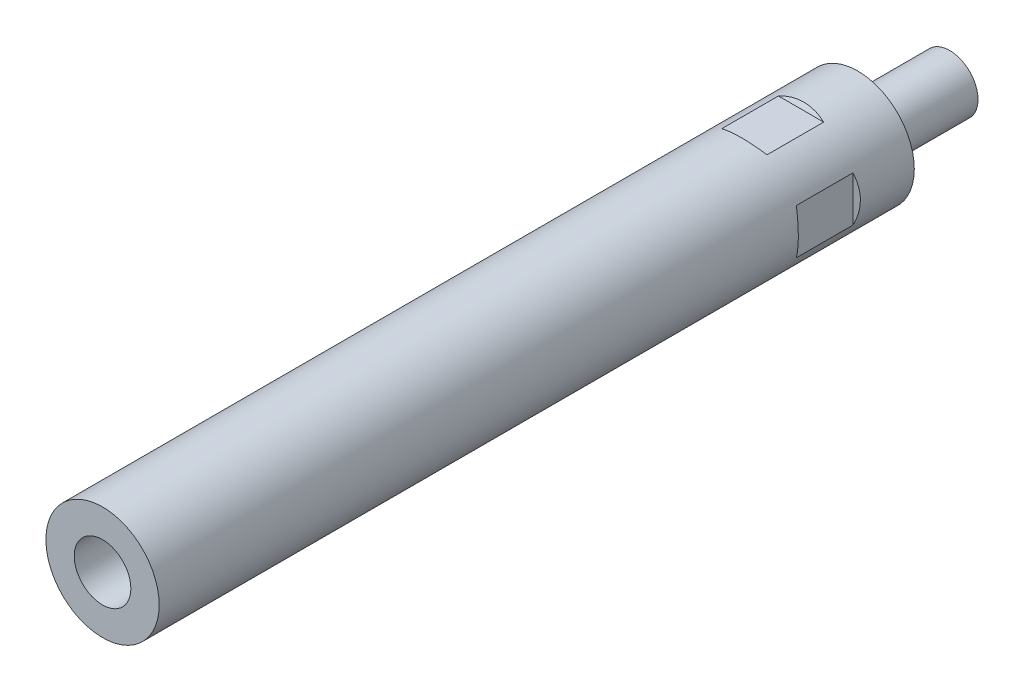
ISO-10303-21;
HEADER;
FILE_DESCRIPTION(('STEP AP214'),'2;1');
FILE_NAME('part.step','',(''),(''),'','','');
FILE_SCHEMA(('AUTOMOTIVE_DESIGN { 1 0 10303 214 1 1 1 1 }'));
ENDSEC;
DATA;
#1=APPLICATION_CONTEXT('core data for automotive mechanical design processes');
#2=APPLICATION_PROTOCOL_DEFINITION('international standard','automotive_design',2000,#1);
#3=PRODUCT_CONTEXT('',#1,'mechanical');
#4=PRODUCT('Part','Part','',(#3));
#5=PRODUCT_RELATED_PRODUCT_CATEGORY('part','',(#4));
#6=PRODUCT_DEFINITION_FORMATION('','',#4);
#7=PRODUCT_DEFINITION_CONTEXT('part definition',#1,'design');
#8=PRODUCT_DEFINITION('design','',#6,#7);
#9=PRODUCT_DEFINITION_SHAPE('','',#8);
#10=(LENGTH_UNIT() NAMED_UNIT(*) SI_UNIT(.MILLI.,.METRE.));
#11=(NAMED_UNIT(*) PLANE_ANGLE_UNIT() SI_UNIT($,.RADIAN.));
#12=(NAMED_UNIT(*) SI_UNIT($,.STERADIAN.) SOLID_ANGLE_UNIT());
#13=UNCERTAINTY_MEASURE_WITH_UNIT(LENGTH_MEASURE(1.E-05),#10,'distance_accuracy_value','');
#14=(GEOMETRIC_REPRESENTATION_CONTEXT(3) GLOBAL_UNCERTAINTY_ASSIGNED_CONTEXT((#13)) GLOBAL_UNIT_ASSIGNED_CONTEXT((#10,
#11,#12)) REPRESENTATION_CONTEXT('',''));
#15=CARTESIAN_POINT('',(0.,0.,0.));
#16=DIRECTION('',(0.,0.,1.));
#17=DIRECTION('',(1.,0.,0.));
#18=AXIS2_PLACEMENT_3D('',#15,#16,#17);
#19=CARTESIAN_POINT('',(0.,0.,0.5));
#20=DIRECTION('',(0.,0.,1.));
#21=DIRECTION('',(0.,-1.,0.));
#22=AXIS2_PLACEMENT_3D('',#19,#20,#21);
#23=CYLINDRICAL_SURFACE('',#22,6.);
#24=CARTESIAN_POINT('',(0.,0.,-19.5));
#25=DIRECTION('',(0.,0.,1.));
#26=DIRECTION('',(0.,-1.,0.));
#27=AXIS2_PLACEMENT_3D('',#24,#25,#26);
#28=CIRCLE('',#27,6.);
#29=CARTESIAN_POINT('',(0.,-6.,-19.5));
#30=VERTEX_POINT('',#29);
#31=EDGE_CURVE('E22',#30,#30,#28,.F.);
#32=ORIENTED_EDGE('',*,*,#31,.F.);
#33=EDGE_LOOP('',(#32));
#34=FACE_BOUND('',#33,.T.);
#35=CARTESIAN_POINT('',(0.,0.,0.));
#36=DIRECTION('',(0.,0.,1.));
#37=DIRECTION('',(1.,0.,0.));
#38=AXIS2_PLACEMENT_3D('',#35,#36,#37);
#39=CIRCLE('',#38,6.);
#40=CARTESIAN_POINT('',(6.,0.,0.));
#41=VERTEX_POINT('',#40);
#42=EDGE_CURVE('E9',#41,#41,#39,.T.);
#43=ORIENTED_EDGE('',*,*,#42,.F.);
#44=EDGE_LOOP('',(#43));
#45=FACE_BOUND('',#44,.T.);
#46=ADVANCED_FACE('F14',(#34,#45),#23,.T.);
#47=CARTESIAN_POINT('',(0.,0.,-19.5));
#48=DIRECTION('',(0.,0.,1.));
#49=DIRECTION('',(0.,-1.,0.));
#50=AXIS2_PLACEMENT_3D('',#47,#48,#49);
#51=PLANE('',#50);
#52=ORIENTED_EDGE('',*,*,#31,.T.);
#53=EDGE_LOOP('',(#52));
#54=FACE_BOUND('',#53,.T.);
#55=ADVANCED_FACE('F16',(#54),#51,.F.);
#56=CARTESIAN_POINT('',(5.1,0.,130.));
#57=DIRECTION('',(0.,0.,-1.));
#58=DIRECTION('',(-1.,0.,0.));
#59=AXIS2_PLACEMENT_3D('',#56,#57,#58);
#60=PLANE('',#59);
#61=CARTESIAN_POINT('',(0.,0.,130.));
#62=DIRECTION('',(0.,0.,1.));
#63=DIRECTION('',(1.,0.,0.));
#64=AXIS2_PLACEMENT_3D('',#61,#62,#63);
#65=CIRCLE('',#64,6.);
#66=CARTESIAN_POINT('',(6.,0.,130.));
#67=VERTEX_POINT('',#66);
#68=EDGE_CURVE('E251',#67,#67,#65,.T.);
#69=ORIENTED_EDGE('',*,*,#68,.T.);
#70=EDGE_LOOP('',(#69));
#71=FACE_BOUND('',#70,.T.);
#72=ADVANCED_FACE('F125',(#71),#60,.F.);
#73=CARTESIAN_POINT('',(0.,0.,160.));
#74=DIRECTION('',(0.,0.,1.));
#75=DIRECTION('',(1.,0.,0.));
#76=AXIS2_PLACEMENT_3D('',#73,#74,#75);
#77=CYLINDRICAL_SURFACE('',#76,6.);
#78=ORIENTED_EDGE('',*,*,#68,.F.);
#79=EDGE_LOOP('',(#78));
#80=FACE_BOUND('',#79,.T.);
#81=CARTESIAN_POINT('',(0.,0.,160.));
#82=DIRECTION('',(0.,0.,1.));
#83=DIRECTION('',(1.,0.,0.));
#84=AXIS2_PLACEMENT_3D('',#81,#82,#83);
#85=CIRCLE('',#84,6.);
#86=CARTESIAN_POINT('',(6.,0.,160.));
#87=VERTEX_POINT('',#86);
#88=EDGE_CURVE('E96',#87,#87,#85,.T.);
#89=ORIENTED_EDGE('',*,*,#88,.T.);
#90=EDGE_LOOP('',(#89));
#91=FACE_BOUND('',#90,.T.);
#92=ADVANCED_FACE('F127',(#80,#91),#77,.F.);
#93=CARTESIAN_POINT('',(0.,0.,160.));
#94=DIRECTION('',(0.,0.,1.));
#95=DIRECTION('',(1.,0.,0.));
#96=AXIS2_PLACEMENT_3D('',#93,#94,#95);
#97=PLANE('',#96);
#98=ORIENTED_EDGE('',*,*,#88,.F.);
#99=EDGE_LOOP('',(#98));
#100=FACE_BOUND('',#99,.T.);
#101=CARTESIAN_POINT('',(0.,0.,160.));
#102=DIRECTION('',(0.,0.,1.));
#103=DIRECTION('',(1.,0.,0.));
#104=AXIS2_PLACEMENT_3D('',#101,#102,#103);
#105=CIRCLE('',#104,12.);
#106=CARTESIAN_POINT('',(12.,0.,160.));
#107=VERTEX_POINT('',#106);
#108=EDGE_CURVE('E239',#107,#107,#105,.T.);
#109=ORIENTED_EDGE('',*,*,#108,.T.);
#110=EDGE_LOOP('',(#109));
#111=FACE_BOUND('',#110,.T.);
#112=ADVANCED_FACE('F134',(#100,#111),#97,.T.);
#113=CARTESIAN_POINT('',(11.,-12.,24.));
#114=DIRECTION('',(-0.5,0.,0.866025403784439));
#115=DIRECTION('',(0.866025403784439,0.,0.5));
#116=AXIS2_PLACEMENT_3D('',#113,#114,#115);
#117=PLANE('',#116);
#118=DIRECTION('',(0.,1.,0.));
#119=VECTOR('',#118,1.);
#120=CARTESIAN_POINT('',(11.,-12.,24.));
#121=LINE('',#120,#119);
#122=CARTESIAN_POINT('',(11.,-4.79583152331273,24.));
#123=VERTEX_POINT('',#122);
#124=CARTESIAN_POINT('',(11.,4.79583152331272,24.));
#125=VERTEX_POINT('',#124);
#126=EDGE_CURVE('E183',#123,#125,#121,.T.);
#127=ORIENTED_EDGE('',*,*,#126,.T.);
#128=CARTESIAN_POINT('',(0.,0.,17.6491470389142));
#129=DIRECTION('',(-0.5,0.,0.866025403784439));
#130=DIRECTION('',(-0.866025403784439,0.,-0.5));
#131=AXIS2_PLACEMENT_3D('',#128,#129,#130);
#132=ELLIPSE('',#131,13.856406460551,12.);
#133=EDGE_CURVE('E35',#123,#125,#132,.T.);
#134=ORIENTED_EDGE('',*,*,#133,.F.);
#135=EDGE_LOOP('',(#127,#134));
#136=FACE_BOUND('',#135,.T.);
#137=ADVANCED_FACE('F175',(#136),#117,.F.);
#138=CARTESIAN_POINT('',(11.,-12.,24.));
#139=DIRECTION('',(-1.,0.,0.));
#140=DIRECTION('',(0.,0.,1.));
#141=AXIS2_PLACEMENT_3D('',#138,#139,#140);
#142=PLANE('',#141);
#143=ORIENTED_EDGE('',*,*,#126,.F.);
#144=DIRECTION('',(0.,0.,-1.));
#145=VECTOR('',#144,1.);
#146=CARTESIAN_POINT('',(11.,-4.79583152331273,160.));
#147=LINE('',#146,#145);
#148=CARTESIAN_POINT('',(11.,-4.79583152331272,12.));
#149=VERTEX_POINT('',#148);
#150=EDGE_CURVE('E191',#149,#123,#147,.F.);
#151=ORIENTED_EDGE('',*,*,#150,.F.);
#152=DIRECTION('',(0.,1.,0.));
#153=VECTOR('',#152,1.);
#154=CARTESIAN_POINT('',(11.,-12.,12.));
#155=LINE('',#154,#153);
#156=CARTESIAN_POINT('',(11.,4.7958315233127,12.));
#157=VERTEX_POINT('',#156);
#158=EDGE_CURVE('E187',#149,#157,#155,.T.);
#159=ORIENTED_EDGE('',*,*,#158,.T.);
#160=DIRECTION('',(0.,0.,-1.));
#161=VECTOR('',#160,1.);
#162=CARTESIAN_POINT('',(11.,4.79583152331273,160.));
#163=LINE('',#162,#161);
#164=EDGE_CURVE('E29',#125,#157,#163,.T.);
#165=ORIENTED_EDGE('',*,*,#164,.F.);
#166=EDGE_LOOP('',(#143,#151,#159,#165));
#167=FACE_BOUND('',#166,.T.);
#168=ADVANCED_FACE('F172',(#167),#142,.F.);
#169=CARTESIAN_POINT('',(11.,-12.,12.));
#170=DIRECTION('',(-0.5,0.,-0.866025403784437));
#171=DIRECTION('',(-0.866025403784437,0.,0.5));
#172=AXIS2_PLACEMENT_3D('',#169,#170,#171);
#173=PLANE('',#172);
#174=CARTESIAN_POINT('',(0.,0.,18.350852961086));
#175=DIRECTION('',(-0.5,0.,-0.866025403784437));
#176=DIRECTION('',(0.866025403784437,0.,-0.5));
#177=AXIS2_PLACEMENT_3D('',#174,#175,#176);
#178=ELLIPSE('',#177,13.856406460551,12.);
#179=EDGE_CURVE('E195',#157,#149,#178,.T.);
#180=ORIENTED_EDGE('',*,*,#179,.F.);
#181=ORIENTED_EDGE('',*,*,#158,.F.);
#182=EDGE_LOOP('',(#180,#181));
#183=FACE_BOUND('',#182,.T.);
#184=ADVANCED_FACE('F167',(#183),#173,.F.);
#185=CARTESIAN_POINT('',(-11.,-12.,12.));
#186=DIRECTION('',(0.5,0.,-0.866025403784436));
#187=DIRECTION('',(-0.866025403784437,0.,-0.5));
#188=AXIS2_PLACEMENT_3D('',#185,#186,#187);
#189=PLANE('',#188);
#190=CARTESIAN_POINT('',(0.,0.,18.350852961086));
#191=DIRECTION('',(0.5,0.,-0.866025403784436));
#192=DIRECTION('',(-0.866025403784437,0.,-0.5));
#193=AXIS2_PLACEMENT_3D('',#190,#191,#192);
#194=ELLIPSE('',#193,13.8564064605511,12.);
#195=CARTESIAN_POINT('',(-11.,-4.79583152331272,12.));
#196=VERTEX_POINT('',#195);
#197=CARTESIAN_POINT('',(-11.,4.7958315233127,12.));
#198=VERTEX_POINT('',#197);
#199=EDGE_CURVE('E193',#196,#198,#194,.T.);
#200=ORIENTED_EDGE('',*,*,#199,.F.);
#201=DIRECTION('',(0.,1.,0.));
#202=VECTOR('',#201,1.);
#203=CARTESIAN_POINT('',(-11.,-12.,12.));
#204=LINE('',#203,#202);
#205=EDGE_CURVE('E227',#196,#198,#204,.T.);
#206=ORIENTED_EDGE('',*,*,#205,.T.);
#207=EDGE_LOOP('',(#200,#206));
#208=FACE_BOUND('',#207,.T.);
#209=ADVANCED_FACE('F163',(#208),#189,.F.);
#210=CARTESIAN_POINT('',(-11.,-12.,24.));
#211=DIRECTION('',(0.5,0.,0.866025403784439));
#212=DIRECTION('',(0.866025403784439,0.,-0.5));
#213=AXIS2_PLACEMENT_3D('',#210,#211,#212);
#214=PLANE('',#213);
#215=DIRECTION('',(0.,1.,0.));
#216=VECTOR('',#215,1.);
#217=CARTESIAN_POINT('',(-11.,-12.,24.));
#218=LINE('',#217,#216);
#219=CARTESIAN_POINT('',(-11.,-4.79583152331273,24.));
#220=VERTEX_POINT('',#219);
#221=CARTESIAN_POINT('',(-11.,4.79583152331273,24.));
#222=VERTEX_POINT('',#221);
#223=EDGE_CURVE('E231',#220,#222,#218,.T.);
#224=ORIENTED_EDGE('',*,*,#223,.F.);
#225=CARTESIAN_POINT('',(0.,0.,17.6491470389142));
#226=DIRECTION('',(0.5,0.,0.866025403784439));
#227=DIRECTION('',(0.866025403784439,0.,-0.5));
#228=AXIS2_PLACEMENT_3D('',#225,#226,#227);
#229=ELLIPSE('',#228,13.856406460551,12.);
#230=EDGE_CURVE('E206',#222,#220,#229,.T.);
#231=ORIENTED_EDGE('',*,*,#230,.F.);
#232=EDGE_LOOP('',(#224,#231));
#233=FACE_BOUND('',#232,.T.);
#234=ADVANCED_FACE('F160',(#233),#214,.F.);
#235=CARTESIAN_POINT('',(-11.,-12.,24.));
#236=DIRECTION('',(1.,0.,0.));
#237=DIRECTION('',(0.,0.,-1.));
#238=AXIS2_PLACEMENT_3D('',#235,#236,#237);
#239=PLANE('',#238);
#240=ORIENTED_EDGE('',*,*,#223,.T.);
#241=DIRECTION('',(0.,0.,-1.));
#242=VECTOR('',#241,1.);
#243=CARTESIAN_POINT('',(-11.,4.79583152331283,160.));
#244=LINE('',#243,#242);
#245=EDGE_CURVE('E200',#198,#222,#244,.F.);
#246=ORIENTED_EDGE('',*,*,#245,.F.);
#247=ORIENTED_EDGE('',*,*,#205,.F.);
#248=DIRECTION('',(0.,0.,-1.));
#249=VECTOR('',#248,1.);
#250=CARTESIAN_POINT('',(-11.,-4.79583152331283,160.));
#251=LINE('',#250,#249);
#252=EDGE_CURVE('E203',#220,#196,#251,.T.);
#253=ORIENTED_EDGE('',*,*,#252,.F.);
#254=EDGE_LOOP('',(#240,#246,#247,#253));
#255=FACE_BOUND('',#254,.T.);
#256=ADVANCED_FACE('F158',(#255),#239,.F.);
#257=CARTESIAN_POINT('',(12.,11.,24.));
#258=DIRECTION('',(0.,-0.5,0.866025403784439));
#259=DIRECTION('',(0.,-0.866025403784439,-0.5));
#260=AXIS2_PLACEMENT_3D('',#257,#258,#259);
#261=PLANE('',#260);
#262=DIRECTION('',(-1.,0.,0.));
#263=VECTOR('',#262,1.);
#264=CARTESIAN_POINT('',(12.,11.,24.));
#265=LINE('',#264,#263);
#266=CARTESIAN_POINT('',(4.79583152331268,11.,24.));
#267=VERTEX_POINT('',#266);
#268=CARTESIAN_POINT('',(-4.79583152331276,11.,24.));
#269=VERTEX_POINT('',#268);
#270=EDGE_CURVE('E225',#267,#269,#265,.T.);
#271=ORIENTED_EDGE('',*,*,#270,.T.);
#272=CARTESIAN_POINT('',(0.,0.,17.6491470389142));
#273=DIRECTION('',(0.,-0.5,0.866025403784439));
#274=DIRECTION('',(0.,-0.866025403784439,-0.5));
#275=AXIS2_PLACEMENT_3D('',#272,#273,#274);
#276=ELLIPSE('',#275,13.856406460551,12.);
#277=EDGE_CURVE('E214',#267,#269,#276,.T.);
#278=ORIENTED_EDGE('',*,*,#277,.F.);
#279=EDGE_LOOP('',(#271,#278));
#280=FACE_BOUND('',#279,.T.);
#281=ADVANCED_FACE('F151',(#280),#261,.F.);
#282=CARTESIAN_POINT('',(12.,11.,24.));
#283=DIRECTION('',(0.,-1.,0.));
#284=DIRECTION('',(1.,0.,0.));
#285=AXIS2_PLACEMENT_3D('',#282,#283,#284);
#286=PLANE('',#285);
#287=ORIENTED_EDGE('',*,*,#270,.F.);
#288=DIRECTION('',(0.,0.,-1.));
#289=VECTOR('',#288,1.);
#290=CARTESIAN_POINT('',(4.79583152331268,11.,160.));
#291=LINE('',#290,#289);
#292=CARTESIAN_POINT('',(4.7958315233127,11.,12.));
#293=VERTEX_POINT('',#292);
#294=EDGE_CURVE('E88',#293,#267,#291,.F.);
#295=ORIENTED_EDGE('',*,*,#294,.F.);
#296=DIRECTION('',(-1.,0.,0.));
#297=VECTOR('',#296,1.);
#298=CARTESIAN_POINT('',(12.,11.,12.));
#299=LINE('',#298,#297);
#300=CARTESIAN_POINT('',(-4.79583152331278,11.,12.));
#301=VERTEX_POINT('',#300);
#302=EDGE_CURVE('E223',#293,#301,#299,.T.);
#303=ORIENTED_EDGE('',*,*,#302,.T.);
#304=DIRECTION('',(0.,0.,-1.));
#305=VECTOR('',#304,1.);
#306=CARTESIAN_POINT('',(-4.79583152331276,11.,160.));
#307=LINE('',#306,#305);
#308=EDGE_CURVE('E211',#269,#301,#307,.T.);
#309=ORIENTED_EDGE('',*,*,#308,.F.);
#310=EDGE_LOOP('',(#287,#295,#303,#309));
#311=FACE_BOUND('',#310,.T.);
#312=ADVANCED_FACE('F148',(#311),#286,.F.);
#313=CARTESIAN_POINT('',(12.,11.,12.));
#314=DIRECTION('',(0.,-0.5,-0.866025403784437));
#315=DIRECTION('',(0.,0.866025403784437,-0.5));
#316=AXIS2_PLACEMENT_3D('',#313,#314,#315);
#317=PLANE('',#316);
#318=CARTESIAN_POINT('',(0.,0.,18.3508529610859));
#319=DIRECTION('',(0.,-0.5,-0.866025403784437));
#320=DIRECTION('',(0.,0.866025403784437,-0.5));
#321=AXIS2_PLACEMENT_3D('',#318,#319,#320);
#322=ELLIPSE('',#321,13.856406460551,12.);
#323=EDGE_CURVE('E209',#301,#293,#322,.T.);
#324=ORIENTED_EDGE('',*,*,#323,.F.);
#325=ORIENTED_EDGE('',*,*,#302,.F.);
#326=EDGE_LOOP('',(#324,#325));
#327=FACE_BOUND('',#326,.T.);
#328=ADVANCED_FACE('F145',(#327),#317,.F.);
#329=CARTESIAN_POINT('',(12.,-11.,12.));
#330=DIRECTION('',(0.,0.5,-0.866025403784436));
#331=DIRECTION('',(0.,0.866025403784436,0.5));
#332=AXIS2_PLACEMENT_3D('',#329,#330,#331);
#333=PLANE('',#332);
#334=CARTESIAN_POINT('',(0.,0.,18.350852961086));
#335=DIRECTION('',(0.,0.5,-0.866025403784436));
#336=DIRECTION('',(0.,-0.866025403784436,-0.5));
#337=AXIS2_PLACEMENT_3D('',#334,#335,#336);
#338=ELLIPSE('',#337,13.8564064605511,12.);
#339=CARTESIAN_POINT('',(4.79583152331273,-11.,12.));
#340=VERTEX_POINT('',#339);
#341=CARTESIAN_POINT('',(-4.79583152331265,-11.,12.));
#342=VERTEX_POINT('',#341);
#343=EDGE_CURVE('E79',#340,#342,#338,.T.);
#344=ORIENTED_EDGE('',*,*,#343,.F.);
#345=DIRECTION('',(-1.,0.,0.));
#346=VECTOR('',#345,1.);
#347=CARTESIAN_POINT('',(12.,-11.,12.));
#348=LINE('',#347,#346);
#349=EDGE_CURVE('E82',#340,#342,#348,.T.);
#350=ORIENTED_EDGE('',*,*,#349,.T.);
#351=EDGE_LOOP('',(#344,#350));
#352=FACE_BOUND('',#351,.T.);
#353=ADVANCED_FACE('F81',(#352),#333,.F.);
#354=CARTESIAN_POINT('',(12.,-11.,24.));
#355=DIRECTION('',(0.,0.5,0.866025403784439));
#356=DIRECTION('',(0.,-0.866025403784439,0.5));
#357=AXIS2_PLACEMENT_3D('',#354,#355,#356);
#358=PLANE('',#357);
#359=DIRECTION('',(-1.,0.,0.));
#360=VECTOR('',#359,1.);
#361=CARTESIAN_POINT('',(12.,-11.,24.));
#362=LINE('',#361,#360);
#363=CARTESIAN_POINT('',(4.79583152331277,-11.,24.));
#364=VERTEX_POINT('',#363);
#365=CARTESIAN_POINT('',(-4.79583152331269,-11.,24.));
#366=VERTEX_POINT('',#365);
#367=EDGE_CURVE('E95',#364,#366,#362,.T.);
#368=ORIENTED_EDGE('',*,*,#367,.F.);
#369=CARTESIAN_POINT('',(0.,0.,17.6491470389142));
#370=DIRECTION('',(0.,0.5,0.866025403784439));
#371=DIRECTION('',(0.,0.866025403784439,-0.5));
#372=AXIS2_PLACEMENT_3D('',#369,#370,#371);
#373=ELLIPSE('',#372,13.856406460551,12.);
#374=EDGE_CURVE('E101',#366,#364,#373,.T.);
#375=ORIENTED_EDGE('',*,*,#374,.F.);
#376=EDGE_LOOP('',(#368,#375));
#377=FACE_BOUND('',#376,.T.);
#378=ADVANCED_FACE('F139',(#377),#358,.F.);
#379=CARTESIAN_POINT('',(12.,-11.,24.));
#380=DIRECTION('',(0.,1.,0.));
#381=DIRECTION('',(-1.,0.,0.));
#382=AXIS2_PLACEMENT_3D('',#379,#380,#381);
#383=PLANE('',#382);
#384=ORIENTED_EDGE('',*,*,#367,.T.);
#385=DIRECTION('',(0.,0.,-1.));
#386=VECTOR('',#385,1.);
#387=CARTESIAN_POINT('',(-4.79583152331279,-11.,160.));
#388=LINE('',#387,#386);
#389=EDGE_CURVE('E87',#342,#366,#388,.F.);
#390=ORIENTED_EDGE('',*,*,#389,.F.);
#391=ORIENTED_EDGE('',*,*,#349,.F.);
#392=DIRECTION('',(0.,0.,-1.));
#393=VECTOR('',#392,1.);
#394=CARTESIAN_POINT('',(4.79583152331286,-11.,160.));
#395=LINE('',#394,#393);
#396=EDGE_CURVE('E93',#364,#340,#395,.T.);
#397=ORIENTED_EDGE('',*,*,#396,.F.);
#398=EDGE_LOOP('',(#384,#390,#391,#397));
#399=FACE_BOUND('',#398,.T.);
#400=ADVANCED_FACE('F92',(#399),#383,.F.);
#401=CARTESIAN_POINT('',(0.,0.,160.));
#402=DIRECTION('',(0.,0.,-1.));
#403=DIRECTION('',(-1.,0.,0.));
#404=AXIS2_PLACEMENT_3D('',#401,#402,#403);
#405=CYLINDRICAL_SURFACE('',#404,12.);
#406=ORIENTED_EDGE('',*,*,#389,.T.);
#407=ORIENTED_EDGE('',*,*,#374,.T.);
#408=ORIENTED_EDGE('',*,*,#396,.T.);
#409=ORIENTED_EDGE('',*,*,#343,.T.);
#410=EDGE_LOOP('',(#406,#407,#408,#409));
#411=FACE_BOUND('',#410,.T.);
#412=ORIENTED_EDGE('',*,*,#323,.T.);
#413=ORIENTED_EDGE('',*,*,#294,.T.);
#414=ORIENTED_EDGE('',*,*,#277,.T.);
#415=ORIENTED_EDGE('',*,*,#308,.T.);
#416=EDGE_LOOP('',(#412,#413,#414,#415));
#417=FACE_BOUND('',#416,.T.);
#418=ORIENTED_EDGE('',*,*,#245,.T.);
#419=ORIENTED_EDGE('',*,*,#230,.T.);
#420=ORIENTED_EDGE('',*,*,#252,.T.);
#421=ORIENTED_EDGE('',*,*,#199,.T.);
#422=EDGE_LOOP('',(#418,#419,#420,#421));
#423=FACE_BOUND('',#422,.T.);
#424=ORIENTED_EDGE('',*,*,#179,.T.);
#425=ORIENTED_EDGE('',*,*,#150,.T.);
#426=ORIENTED_EDGE('',*,*,#133,.T.);
#427=ORIENTED_EDGE('',*,*,#164,.T.);
#428=EDGE_LOOP('',(#424,#425,#426,#427));
#429=FACE_BOUND('',#428,.T.);
#430=ORIENTED_EDGE('',*,*,#108,.F.);
#431=EDGE_LOOP('',(#430));
#432=FACE_BOUND('',#431,.T.);
#433=CARTESIAN_POINT('',(0.,0.,0.));
#434=DIRECTION('',(0.,0.,1.));
#435=DIRECTION('',(1.,0.,0.));
#436=AXIS2_PLACEMENT_3D('',#433,#434,#435);
#437=CIRCLE('',#436,12.);
#438=CARTESIAN_POINT('',(12.,0.,0.));
#439=VERTEX_POINT('',#438);
#440=EDGE_CURVE('E186',#439,#439,#437,.T.);
#441=ORIENTED_EDGE('',*,*,#440,.T.);
#442=EDGE_LOOP('',(#441));
#443=FACE_BOUND('',#442,.T.);
#444=ADVANCED_FACE('F99',(#411,#417,#423,#429,#432,#443),#405,.T.);
#445=CARTESIAN_POINT('',(0.,0.,0.));
#446=DIRECTION('',(0.,0.,1.));
#447=DIRECTION('',(1.,0.,0.));
#448=AXIS2_PLACEMENT_3D('',#445,#446,#447);
#449=PLANE('',#448);
#450=ORIENTED_EDGE('',*,*,#440,.F.);
#451=EDGE_LOOP('',(#450));
#452=FACE_BOUND('',#451,.T.);
#453=ORIENTED_EDGE('',*,*,#42,.T.);
#454=EDGE_LOOP('',(#453));
#455=FACE_BOUND('',#454,.T.);
#456=ADVANCED_FACE('F111',(#452,#455),#449,.F.);
#457=CLOSED_SHELL('',(#46,#55,#72,#92,#112,#137,#168,#184,#209,#234,#256,#281,#312,#328,#353,
#378,#400,#444,#456));
#458=MANIFOLD_SOLID_BREP('B1',#457);
#459=ADVANCED_BREP_SHAPE_REPRESENTATION('',(#18,#458),#14);
#460=SHAPE_DEFINITION_REPRESENTATION(#9,#459);
ENDSEC;
END-ISO-10303-21;
